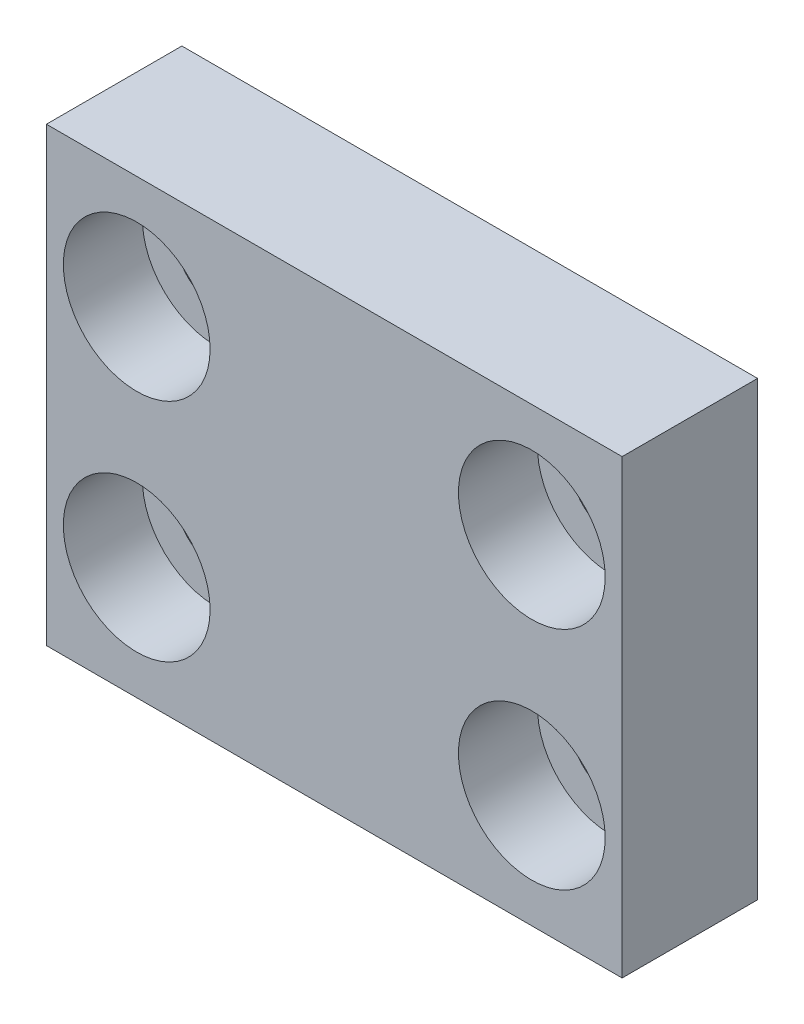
ISO-10303-21;
HEADER;
FILE_DESCRIPTION(('STEP AP214'),'2;1');
FILE_NAME('part.step','',(''),(''),'','','');
FILE_SCHEMA(('AUTOMOTIVE_DESIGN { 1 0 10303 214 1 1 1 1 }'));
ENDSEC;
DATA;
#1=APPLICATION_CONTEXT('core data for automotive mechanical design processes');
#2=APPLICATION_PROTOCOL_DEFINITION('international standard','automotive_design',2000,#1);
#3=PRODUCT_CONTEXT('',#1,'mechanical');
#4=PRODUCT('Part','Part','',(#3));
#5=PRODUCT_RELATED_PRODUCT_CATEGORY('part','',(#4));
#6=PRODUCT_DEFINITION_FORMATION('','',#4);
#7=PRODUCT_DEFINITION_CONTEXT('part definition',#1,'design');
#8=PRODUCT_DEFINITION('design','',#6,#7);
#9=PRODUCT_DEFINITION_SHAPE('','',#8);
#10=(LENGTH_UNIT() NAMED_UNIT(*) SI_UNIT(.MILLI.,.METRE.));
#11=(NAMED_UNIT(*) PLANE_ANGLE_UNIT() SI_UNIT($,.RADIAN.));
#12=(NAMED_UNIT(*) SI_UNIT($,.STERADIAN.) SOLID_ANGLE_UNIT());
#13=UNCERTAINTY_MEASURE_WITH_UNIT(LENGTH_MEASURE(1.E-05),#10,'distance_accuracy_value','');
#14=(GEOMETRIC_REPRESENTATION_CONTEXT(3) GLOBAL_UNCERTAINTY_ASSIGNED_CONTEXT((#13)) GLOBAL_UNIT_ASSIGNED_CONTEXT((#10,
#11,#12)) REPRESENTATION_CONTEXT('',''));
#15=CARTESIAN_POINT('',(0.,0.,0.));
#16=DIRECTION('',(0.,0.,1.));
#17=DIRECTION('',(1.,0.,0.));
#18=AXIS2_PLACEMENT_3D('',#15,#16,#17);
#19=CARTESIAN_POINT('',(4.,-5.,6.));
#20=DIRECTION('',(0.,0.,-1.));
#21=DIRECTION('',(-1.,0.,0.));
#22=AXIS2_PLACEMENT_3D('',#19,#20,#21);
#23=CYLINDRICAL_SURFACE('',#22,1.75);
#24=CARTESIAN_POINT('',(4.,-5.,0.));
#25=DIRECTION('',(0.,0.,1.));
#26=DIRECTION('',(1.,0.,0.));
#27=AXIS2_PLACEMENT_3D('',#24,#25,#26);
#28=CIRCLE('',#27,1.75);
#29=CARTESIAN_POINT('',(5.75,-5.,0.));
#30=VERTEX_POINT('',#29);
#31=EDGE_CURVE('E111',#30,#30,#28,.T.);
#32=ORIENTED_EDGE('',*,*,#31,.F.);
#33=EDGE_LOOP('',(#32));
#34=FACE_BOUND('',#33,.T.);
#35=CARTESIAN_POINT('',(4.,-5.,2.5));
#36=DIRECTION('',(0.,0.,1.));
#37=DIRECTION('',(1.,0.,0.));
#38=AXIS2_PLACEMENT_3D('',#35,#36,#37);
#39=CIRCLE('',#38,1.75);
#40=CARTESIAN_POINT('',(5.75,-5.,2.5));
#41=VERTEX_POINT('',#40);
#42=EDGE_CURVE('E36',#41,#41,#39,.T.);
#43=ORIENTED_EDGE('',*,*,#42,.T.);
#44=EDGE_LOOP('',(#43));
#45=FACE_BOUND('',#44,.T.);
#46=ADVANCED_FACE('F32',(#34,#45),#23,.F.);
#47=CARTESIAN_POINT('',(21.5,-5.,6.));
#48=DIRECTION('',(0.,0.,-1.));
#49=DIRECTION('',(-1.,0.,0.));
#50=AXIS2_PLACEMENT_3D('',#47,#48,#49);
#51=CYLINDRICAL_SURFACE('',#50,1.75);
#52=CARTESIAN_POINT('',(21.5,-5.,0.));
#53=DIRECTION('',(0.,0.,1.));
#54=DIRECTION('',(1.,0.,0.));
#55=AXIS2_PLACEMENT_3D('',#52,#53,#54);
#56=CIRCLE('',#55,1.75);
#57=CARTESIAN_POINT('',(23.25,-5.,0.));
#58=VERTEX_POINT('',#57);
#59=EDGE_CURVE('E144',#58,#58,#56,.T.);
#60=ORIENTED_EDGE('',*,*,#59,.F.);
#61=EDGE_LOOP('',(#60));
#62=FACE_BOUND('',#61,.T.);
#63=CARTESIAN_POINT('',(21.5,-5.,2.5));
#64=DIRECTION('',(0.,0.,1.));
#65=DIRECTION('',(1.,0.,0.));
#66=AXIS2_PLACEMENT_3D('',#63,#64,#65);
#67=CIRCLE('',#66,1.75);
#68=CARTESIAN_POINT('',(23.25,-5.,2.5));
#69=VERTEX_POINT('',#68);
#70=EDGE_CURVE('E117',#69,#69,#67,.T.);
#71=ORIENTED_EDGE('',*,*,#70,.T.);
#72=EDGE_LOOP('',(#71));
#73=FACE_BOUND('',#72,.T.);
#74=ADVANCED_FACE('F188',(#62,#73),#51,.F.);
#75=CARTESIAN_POINT('',(21.5,-15.,6.));
#76=DIRECTION('',(0.,0.,-1.));
#77=DIRECTION('',(-1.,0.,0.));
#78=AXIS2_PLACEMENT_3D('',#75,#76,#77);
#79=CYLINDRICAL_SURFACE('',#78,1.75);
#80=CARTESIAN_POINT('',(21.5,-15.,0.));
#81=DIRECTION('',(0.,0.,1.));
#82=DIRECTION('',(1.,0.,0.));
#83=AXIS2_PLACEMENT_3D('',#80,#81,#82);
#84=CIRCLE('',#83,1.75);
#85=CARTESIAN_POINT('',(23.25,-15.,0.));
#86=VERTEX_POINT('',#85);
#87=EDGE_CURVE('E147',#86,#86,#84,.T.);
#88=ORIENTED_EDGE('',*,*,#87,.F.);
#89=EDGE_LOOP('',(#88));
#90=FACE_BOUND('',#89,.T.);
#91=CARTESIAN_POINT('',(21.5,-15.,2.5));
#92=DIRECTION('',(0.,0.,1.));
#93=DIRECTION('',(1.,0.,0.));
#94=AXIS2_PLACEMENT_3D('',#91,#92,#93);
#95=CIRCLE('',#94,1.75);
#96=CARTESIAN_POINT('',(23.25,-15.,2.5));
#97=VERTEX_POINT('',#96);
#98=EDGE_CURVE('E113',#97,#97,#95,.T.);
#99=ORIENTED_EDGE('',*,*,#98,.T.);
#100=EDGE_LOOP('',(#99));
#101=FACE_BOUND('',#100,.T.);
#102=ADVANCED_FACE('F159',(#90,#101),#79,.F.);
#103=CARTESIAN_POINT('',(4.,-15.,6.));
#104=DIRECTION('',(0.,0.,-1.));
#105=DIRECTION('',(-1.,0.,0.));
#106=AXIS2_PLACEMENT_3D('',#103,#104,#105);
#107=CYLINDRICAL_SURFACE('',#106,1.75);
#108=CARTESIAN_POINT('',(4.,-15.,0.));
#109=DIRECTION('',(0.,0.,1.));
#110=DIRECTION('',(1.,0.,0.));
#111=AXIS2_PLACEMENT_3D('',#108,#109,#110);
#112=CIRCLE('',#111,1.75);
#113=CARTESIAN_POINT('',(5.75,-15.,0.));
#114=VERTEX_POINT('',#113);
#115=EDGE_CURVE('E102',#114,#114,#112,.T.);
#116=ORIENTED_EDGE('',*,*,#115,.F.);
#117=EDGE_LOOP('',(#116));
#118=FACE_BOUND('',#117,.T.);
#119=CARTESIAN_POINT('',(4.,-15.,2.5));
#120=DIRECTION('',(0.,0.,1.));
#121=DIRECTION('',(1.,0.,0.));
#122=AXIS2_PLACEMENT_3D('',#119,#120,#121);
#123=CIRCLE('',#122,1.75);
#124=CARTESIAN_POINT('',(5.75,-15.,2.5));
#125=VERTEX_POINT('',#124);
#126=EDGE_CURVE('E108',#125,#125,#123,.T.);
#127=ORIENTED_EDGE('',*,*,#126,.T.);
#128=EDGE_LOOP('',(#127));
#129=FACE_BOUND('',#128,.T.);
#130=ADVANCED_FACE('F156',(#118,#129),#107,.F.);
#131=CARTESIAN_POINT('',(0.,0.,6.));
#132=DIRECTION('',(0.,0.,-1.));
#133=DIRECTION('',(-1.,0.,0.));
#134=AXIS2_PLACEMENT_3D('',#131,#132,#133);
#135=PLANE('',#134);
#136=CARTESIAN_POINT('',(4.,-5.,6.));
#137=DIRECTION('',(0.,0.,1.));
#138=DIRECTION('',(1.,0.,0.));
#139=AXIS2_PLACEMENT_3D('',#136,#137,#138);
#140=CIRCLE('',#139,3.25);
#141=CARTESIAN_POINT('',(7.25,-5.,6.));
#142=VERTEX_POINT('',#141);
#143=EDGE_CURVE('E133',#142,#142,#140,.T.);
#144=ORIENTED_EDGE('',*,*,#143,.F.);
#145=EDGE_LOOP('',(#144));
#146=FACE_BOUND('',#145,.T.);
#147=CARTESIAN_POINT('',(21.5,-5.,6.));
#148=DIRECTION('',(0.,0.,1.));
#149=DIRECTION('',(1.,0.,0.));
#150=AXIS2_PLACEMENT_3D('',#147,#148,#149);
#151=CIRCLE('',#150,3.25);
#152=CARTESIAN_POINT('',(24.75,-5.,6.));
#153=VERTEX_POINT('',#152);
#154=EDGE_CURVE('E126',#153,#153,#151,.T.);
#155=ORIENTED_EDGE('',*,*,#154,.F.);
#156=EDGE_LOOP('',(#155));
#157=FACE_BOUND('',#156,.T.);
#158=CARTESIAN_POINT('',(21.5,-15.,6.));
#159=DIRECTION('',(0.,0.,1.));
#160=DIRECTION('',(1.,0.,0.));
#161=AXIS2_PLACEMENT_3D('',#158,#159,#160);
#162=CIRCLE('',#161,3.25);
#163=CARTESIAN_POINT('',(24.75,-15.,6.));
#164=VERTEX_POINT('',#163);
#165=EDGE_CURVE('E119',#164,#164,#162,.T.);
#166=ORIENTED_EDGE('',*,*,#165,.F.);
#167=EDGE_LOOP('',(#166));
#168=FACE_BOUND('',#167,.T.);
#169=CARTESIAN_POINT('',(4.,-15.,6.));
#170=DIRECTION('',(0.,0.,1.));
#171=DIRECTION('',(1.,0.,0.));
#172=AXIS2_PLACEMENT_3D('',#169,#170,#171);
#173=CIRCLE('',#172,3.25);
#174=CARTESIAN_POINT('',(7.25,-15.,6.));
#175=VERTEX_POINT('',#174);
#176=EDGE_CURVE('E115',#175,#175,#173,.T.);
#177=ORIENTED_EDGE('',*,*,#176,.F.);
#178=EDGE_LOOP('',(#177));
#179=FACE_BOUND('',#178,.T.);
#180=DIRECTION('',(0.,-1.,0.));
#181=VECTOR('',#180,1.);
#182=CARTESIAN_POINT('',(0.,-20.,6.));
#183=LINE('',#182,#181);
#184=CARTESIAN_POINT('',(0.,0.,6.));
#185=VERTEX_POINT('',#184);
#186=CARTESIAN_POINT('',(0.,-20.,6.));
#187=VERTEX_POINT('',#186);
#188=EDGE_CURVE('E86',#185,#187,#183,.T.);
#189=ORIENTED_EDGE('',*,*,#188,.T.);
#190=DIRECTION('',(1.,0.,0.));
#191=VECTOR('',#190,1.);
#192=CARTESIAN_POINT('',(0.,-20.,6.));
#193=LINE('',#192,#191);
#194=CARTESIAN_POINT('',(25.5,-20.,6.));
#195=VERTEX_POINT('',#194);
#196=EDGE_CURVE('E81',#187,#195,#193,.T.);
#197=ORIENTED_EDGE('',*,*,#196,.T.);
#198=DIRECTION('',(0.,1.,0.));
#199=VECTOR('',#198,1.);
#200=CARTESIAN_POINT('',(25.5,-20.,6.));
#201=LINE('',#200,#199);
#202=CARTESIAN_POINT('',(25.5,0.,6.));
#203=VERTEX_POINT('',#202);
#204=EDGE_CURVE('E84',#195,#203,#201,.T.);
#205=ORIENTED_EDGE('',*,*,#204,.T.);
#206=DIRECTION('',(-1.,0.,0.));
#207=VECTOR('',#206,1.);
#208=CARTESIAN_POINT('',(0.,0.,6.));
#209=LINE('',#208,#207);
#210=EDGE_CURVE('E51',#203,#185,#209,.T.);
#211=ORIENTED_EDGE('',*,*,#210,.T.);
#212=EDGE_LOOP('',(#189,#197,#205,#211));
#213=FACE_BOUND('',#212,.T.);
#214=ADVANCED_FACE('F82',(#146,#157,#168,#179,#213),#135,.F.);
#215=CARTESIAN_POINT('',(0.,0.,0.));
#216=DIRECTION('',(0.,0.,-1.));
#217=DIRECTION('',(-1.,0.,0.));
#218=AXIS2_PLACEMENT_3D('',#215,#216,#217);
#219=PLANE('',#218);
#220=ORIENTED_EDGE('',*,*,#59,.T.);
#221=EDGE_LOOP('',(#220));
#222=FACE_BOUND('',#221,.T.);
#223=ORIENTED_EDGE('',*,*,#115,.T.);
#224=EDGE_LOOP('',(#223));
#225=FACE_BOUND('',#224,.T.);
#226=DIRECTION('',(0.,-1.,0.));
#227=VECTOR('',#226,1.);
#228=CARTESIAN_POINT('',(0.,-20.,0.));
#229=LINE('',#228,#227);
#230=CARTESIAN_POINT('',(0.,0.,0.));
#231=VERTEX_POINT('',#230);
#232=CARTESIAN_POINT('',(0.,-20.,0.));
#233=VERTEX_POINT('',#232);
#234=EDGE_CURVE('E99',#231,#233,#229,.T.);
#235=ORIENTED_EDGE('',*,*,#234,.F.);
#236=DIRECTION('',(-1.,0.,0.));
#237=VECTOR('',#236,1.);
#238=CARTESIAN_POINT('',(0.,0.,0.));
#239=LINE('',#238,#237);
#240=CARTESIAN_POINT('',(25.5,0.,0.));
#241=VERTEX_POINT('',#240);
#242=EDGE_CURVE('E74',#241,#231,#239,.T.);
#243=ORIENTED_EDGE('',*,*,#242,.F.);
#244=DIRECTION('',(0.,1.,0.));
#245=VECTOR('',#244,1.);
#246=CARTESIAN_POINT('',(25.5,-20.,0.));
#247=LINE('',#246,#245);
#248=CARTESIAN_POINT('',(25.5,-20.,0.));
#249=VERTEX_POINT('',#248);
#250=EDGE_CURVE('E68',#249,#241,#247,.T.);
#251=ORIENTED_EDGE('',*,*,#250,.F.);
#252=DIRECTION('',(1.,0.,0.));
#253=VECTOR('',#252,1.);
#254=CARTESIAN_POINT('',(0.,-20.,0.));
#255=LINE('',#254,#253);
#256=EDGE_CURVE('E90',#233,#249,#255,.T.);
#257=ORIENTED_EDGE('',*,*,#256,.F.);
#258=EDGE_LOOP('',(#235,#243,#251,#257));
#259=FACE_BOUND('',#258,.T.);
#260=ORIENTED_EDGE('',*,*,#87,.T.);
#261=EDGE_LOOP('',(#260));
#262=FACE_BOUND('',#261,.T.);
#263=ORIENTED_EDGE('',*,*,#31,.T.);
#264=EDGE_LOOP('',(#263));
#265=FACE_BOUND('',#264,.T.);
#266=ADVANCED_FACE('F153',(#222,#225,#259,#262,#265),#219,.T.);
#267=CARTESIAN_POINT('',(0.,-20.,6.));
#268=DIRECTION('',(1.,0.,0.));
#269=DIRECTION('',(0.,0.,-1.));
#270=AXIS2_PLACEMENT_3D('',#267,#268,#269);
#271=PLANE('',#270);
#272=ORIENTED_EDGE('',*,*,#234,.T.);
#273=DIRECTION('',(0.,0.,-1.));
#274=VECTOR('',#273,1.);
#275=CARTESIAN_POINT('',(0.,-20.,6.));
#276=LINE('',#275,#274);
#277=EDGE_CURVE('E11',#187,#233,#276,.T.);
#278=ORIENTED_EDGE('',*,*,#277,.F.);
#279=ORIENTED_EDGE('',*,*,#188,.F.);
#280=DIRECTION('',(0.,0.,-1.));
#281=VECTOR('',#280,1.);
#282=CARTESIAN_POINT('',(0.,0.,6.));
#283=LINE('',#282,#281);
#284=EDGE_CURVE('E95',#185,#231,#283,.T.);
#285=ORIENTED_EDGE('',*,*,#284,.T.);
#286=EDGE_LOOP('',(#272,#278,#279,#285));
#287=FACE_BOUND('',#286,.T.);
#288=ADVANCED_FACE('F34',(#287),#271,.F.);
#289=CARTESIAN_POINT('',(0.,-20.,6.));
#290=DIRECTION('',(0.,1.,0.));
#291=DIRECTION('',(0.,0.,1.));
#292=AXIS2_PLACEMENT_3D('',#289,#290,#291);
#293=PLANE('',#292);
#294=ORIENTED_EDGE('',*,*,#256,.T.);
#295=DIRECTION('',(0.,0.,-1.));
#296=VECTOR('',#295,1.);
#297=CARTESIAN_POINT('',(25.5,-20.,6.));
#298=LINE('',#297,#296);
#299=EDGE_CURVE('E42',#195,#249,#298,.T.);
#300=ORIENTED_EDGE('',*,*,#299,.F.);
#301=ORIENTED_EDGE('',*,*,#196,.F.);
#302=ORIENTED_EDGE('',*,*,#277,.T.);
#303=EDGE_LOOP('',(#294,#300,#301,#302));
#304=FACE_BOUND('',#303,.T.);
#305=ADVANCED_FACE('F89',(#304),#293,.F.);
#306=CARTESIAN_POINT('',(25.5,-20.,6.));
#307=DIRECTION('',(-1.,0.,0.));
#308=DIRECTION('',(0.,0.,1.));
#309=AXIS2_PLACEMENT_3D('',#306,#307,#308);
#310=PLANE('',#309);
#311=ORIENTED_EDGE('',*,*,#250,.T.);
#312=DIRECTION('',(0.,0.,-1.));
#313=VECTOR('',#312,1.);
#314=CARTESIAN_POINT('',(25.5,0.,6.));
#315=LINE('',#314,#313);
#316=EDGE_CURVE('E91',#203,#241,#315,.T.);
#317=ORIENTED_EDGE('',*,*,#316,.F.);
#318=ORIENTED_EDGE('',*,*,#204,.F.);
#319=ORIENTED_EDGE('',*,*,#299,.T.);
#320=EDGE_LOOP('',(#311,#317,#318,#319));
#321=FACE_BOUND('',#320,.T.);
#322=ADVANCED_FACE('F93',(#321),#310,.F.);
#323=CARTESIAN_POINT('',(0.,0.,6.));
#324=DIRECTION('',(0.,-1.,0.));
#325=DIRECTION('',(0.,0.,-1.));
#326=AXIS2_PLACEMENT_3D('',#323,#324,#325);
#327=PLANE('',#326);
#328=ORIENTED_EDGE('',*,*,#242,.T.);
#329=ORIENTED_EDGE('',*,*,#284,.F.);
#330=ORIENTED_EDGE('',*,*,#210,.F.);
#331=ORIENTED_EDGE('',*,*,#316,.T.);
#332=EDGE_LOOP('',(#328,#329,#330,#331));
#333=FACE_BOUND('',#332,.T.);
#334=ADVANCED_FACE('F173',(#333),#327,.F.);
#335=CARTESIAN_POINT('',(4.,-15.,2.5));
#336=DIRECTION('',(0.,0.,1.));
#337=DIRECTION('',(1.,0.,0.));
#338=AXIS2_PLACEMENT_3D('',#335,#336,#337);
#339=CYLINDRICAL_SURFACE('',#338,3.25);
#340=CARTESIAN_POINT('',(4.,-15.,2.5));
#341=DIRECTION('',(0.,0.,1.));
#342=DIRECTION('',(1.,0.,0.));
#343=AXIS2_PLACEMENT_3D('',#340,#341,#342);
#344=CIRCLE('',#343,3.25);
#345=CARTESIAN_POINT('',(7.25,-15.,2.5));
#346=VERTEX_POINT('',#345);
#347=EDGE_CURVE('E112',#346,#346,#344,.T.);
#348=ORIENTED_EDGE('',*,*,#347,.F.);
#349=EDGE_LOOP('',(#348));
#350=FACE_BOUND('',#349,.T.);
#351=ORIENTED_EDGE('',*,*,#176,.T.);
#352=EDGE_LOOP('',(#351));
#353=FACE_BOUND('',#352,.T.);
#354=ADVANCED_FACE('F167',(#350,#353),#339,.F.);
#355=CARTESIAN_POINT('',(4.,-15.,2.5));
#356=DIRECTION('',(0.,0.,1.));
#357=DIRECTION('',(1.,0.,0.));
#358=AXIS2_PLACEMENT_3D('',#355,#356,#357);
#359=PLANE('',#358);
#360=ORIENTED_EDGE('',*,*,#126,.F.);
#361=EDGE_LOOP('',(#360));
#362=FACE_BOUND('',#361,.T.);
#363=ORIENTED_EDGE('',*,*,#347,.T.);
#364=EDGE_LOOP('',(#363));
#365=FACE_BOUND('',#364,.T.);
#366=ADVANCED_FACE('F163',(#362,#365),#359,.T.);
#367=CARTESIAN_POINT('',(21.5,-15.,2.5));
#368=DIRECTION('',(0.,0.,1.));
#369=DIRECTION('',(1.,0.,0.));
#370=AXIS2_PLACEMENT_3D('',#367,#368,#369);
#371=CYLINDRICAL_SURFACE('',#370,3.25);
#372=CARTESIAN_POINT('',(21.5,-15.,2.5));
#373=DIRECTION('',(0.,0.,1.));
#374=DIRECTION('',(1.,0.,0.));
#375=AXIS2_PLACEMENT_3D('',#372,#373,#374);
#376=CIRCLE('',#375,3.25);
#377=CARTESIAN_POINT('',(24.75,-15.,2.5));
#378=VERTEX_POINT('',#377);
#379=EDGE_CURVE('E116',#378,#378,#376,.T.);
#380=ORIENTED_EDGE('',*,*,#379,.F.);
#381=EDGE_LOOP('',(#380));
#382=FACE_BOUND('',#381,.T.);
#383=ORIENTED_EDGE('',*,*,#165,.T.);
#384=EDGE_LOOP('',(#383));
#385=FACE_BOUND('',#384,.T.);
#386=ADVANCED_FACE('F166',(#382,#385),#371,.F.);
#387=CARTESIAN_POINT('',(21.5,-15.,2.5));
#388=DIRECTION('',(0.,0.,1.));
#389=DIRECTION('',(1.,0.,0.));
#390=AXIS2_PLACEMENT_3D('',#387,#388,#389);
#391=PLANE('',#390);
#392=ORIENTED_EDGE('',*,*,#98,.F.);
#393=EDGE_LOOP('',(#392));
#394=FACE_BOUND('',#393,.T.);
#395=ORIENTED_EDGE('',*,*,#379,.T.);
#396=EDGE_LOOP('',(#395));
#397=FACE_BOUND('',#396,.T.);
#398=ADVANCED_FACE('F207',(#394,#397),#391,.T.);
#399=CARTESIAN_POINT('',(21.5,-5.,2.5));
#400=DIRECTION('',(0.,0.,1.));
#401=DIRECTION('',(1.,0.,0.));
#402=AXIS2_PLACEMENT_3D('',#399,#400,#401);
#403=CYLINDRICAL_SURFACE('',#402,3.25);
#404=CARTESIAN_POINT('',(21.5,-5.,2.5));
#405=DIRECTION('',(0.,0.,1.));
#406=DIRECTION('',(1.,0.,0.));
#407=AXIS2_PLACEMENT_3D('',#404,#405,#406);
#408=CIRCLE('',#407,3.25);
#409=CARTESIAN_POINT('',(24.75,-5.,2.5));
#410=VERTEX_POINT('',#409);
#411=EDGE_CURVE('E120',#410,#410,#408,.T.);
#412=ORIENTED_EDGE('',*,*,#411,.F.);
#413=EDGE_LOOP('',(#412));
#414=FACE_BOUND('',#413,.T.);
#415=ORIENTED_EDGE('',*,*,#154,.T.);
#416=EDGE_LOOP('',(#415));
#417=FACE_BOUND('',#416,.T.);
#418=ADVANCED_FACE('F210',(#414,#417),#403,.F.);
#419=CARTESIAN_POINT('',(21.5,-5.,2.5));
#420=DIRECTION('',(0.,0.,1.));
#421=DIRECTION('',(1.,0.,0.));
#422=AXIS2_PLACEMENT_3D('',#419,#420,#421);
#423=PLANE('',#422);
#424=ORIENTED_EDGE('',*,*,#70,.F.);
#425=EDGE_LOOP('',(#424));
#426=FACE_BOUND('',#425,.T.);
#427=ORIENTED_EDGE('',*,*,#411,.T.);
#428=EDGE_LOOP('',(#427));
#429=FACE_BOUND('',#428,.T.);
#430=ADVANCED_FACE('F224',(#426,#429),#423,.T.);
#431=CARTESIAN_POINT('',(4.,-5.,2.5));
#432=DIRECTION('',(0.,0.,1.));
#433=DIRECTION('',(1.,0.,0.));
#434=AXIS2_PLACEMENT_3D('',#431,#432,#433);
#435=CYLINDRICAL_SURFACE('',#434,3.25);
#436=CARTESIAN_POINT('',(4.,-5.,2.5));
#437=DIRECTION('',(0.,0.,1.));
#438=DIRECTION('',(1.,0.,0.));
#439=AXIS2_PLACEMENT_3D('',#436,#437,#438);
#440=CIRCLE('',#439,3.25);
#441=CARTESIAN_POINT('',(7.25,-5.,2.5));
#442=VERTEX_POINT('',#441);
#443=EDGE_CURVE('E243',#442,#442,#440,.T.);
#444=ORIENTED_EDGE('',*,*,#443,.F.);
#445=EDGE_LOOP('',(#444));
#446=FACE_BOUND('',#445,.T.);
#447=ORIENTED_EDGE('',*,*,#143,.T.);
#448=EDGE_LOOP('',(#447));
#449=FACE_BOUND('',#448,.T.);
#450=ADVANCED_FACE('F228',(#446,#449),#435,.F.);
#451=CARTESIAN_POINT('',(4.,-5.,2.5));
#452=DIRECTION('',(0.,0.,1.));
#453=DIRECTION('',(1.,0.,0.));
#454=AXIS2_PLACEMENT_3D('',#451,#452,#453);
#455=PLANE('',#454);
#456=ORIENTED_EDGE('',*,*,#42,.F.);
#457=EDGE_LOOP('',(#456));
#458=FACE_BOUND('',#457,.T.);
#459=ORIENTED_EDGE('',*,*,#443,.T.);
#460=EDGE_LOOP('',(#459));
#461=FACE_BOUND('',#460,.T.);
#462=ADVANCED_FACE('F232',(#458,#461),#455,.T.);
#463=CLOSED_SHELL('',(#46,#74,#102,#130,#214,#266,#288,#305,#322,#334,#354,#366,#386,#398,#418,
#430,#450,#462));
#464=MANIFOLD_SOLID_BREP('B2',#463);
#465=ADVANCED_BREP_SHAPE_REPRESENTATION('',(#18,#464),#14);
#466=SHAPE_DEFINITION_REPRESENTATION(#9,#465);
ENDSEC;
END-ISO-10303-21;
